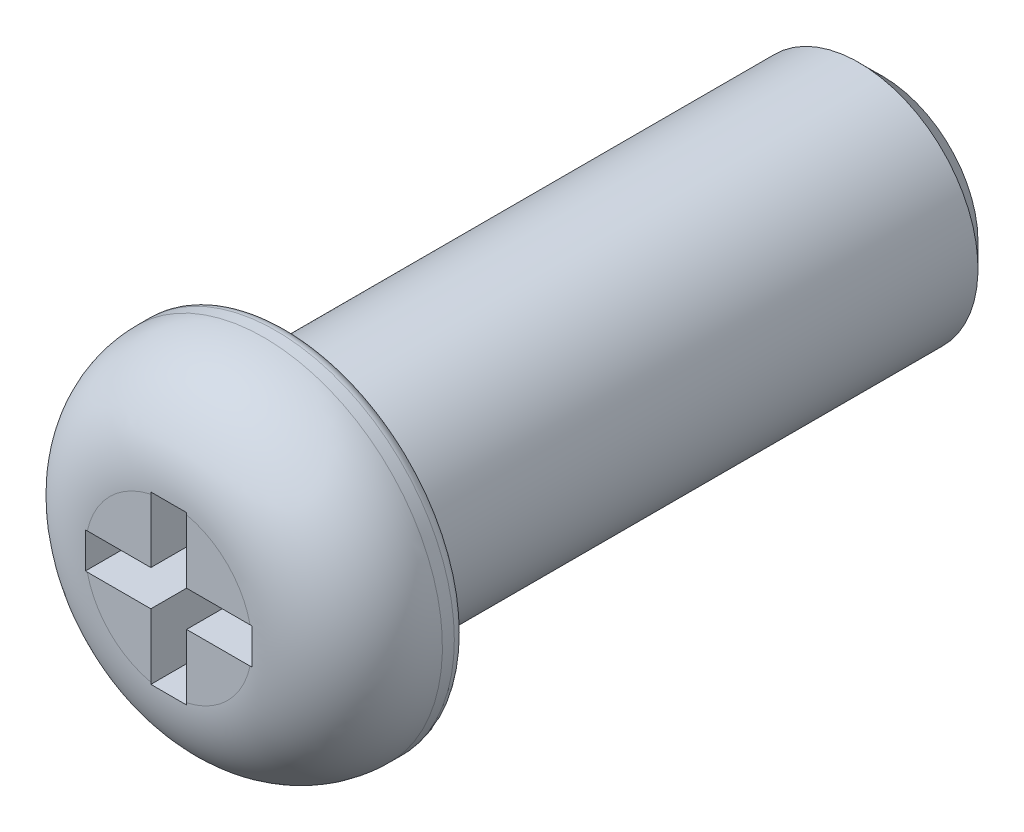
ISO-10303-21;
HEADER;
FILE_DESCRIPTION(('STEP AP214'),'2;1');
FILE_NAME('part.step','',(''),(''),'','','');
FILE_SCHEMA(('AUTOMOTIVE_DESIGN { 1 0 10303 214 1 1 1 1 }'));
ENDSEC;
DATA;
#1=APPLICATION_CONTEXT('core data for automotive mechanical design processes');
#2=APPLICATION_PROTOCOL_DEFINITION('international standard','automotive_design',2000,#1);
#3=PRODUCT_CONTEXT('',#1,'mechanical');
#4=PRODUCT('Part','Part','',(#3));
#5=PRODUCT_RELATED_PRODUCT_CATEGORY('part','',(#4));
#6=PRODUCT_DEFINITION_FORMATION('','',#4);
#7=PRODUCT_DEFINITION_CONTEXT('part definition',#1,'design');
#8=PRODUCT_DEFINITION('design','',#6,#7);
#9=PRODUCT_DEFINITION_SHAPE('','',#8);
#10=(LENGTH_UNIT() NAMED_UNIT(*) SI_UNIT(.MILLI.,.METRE.));
#11=(NAMED_UNIT(*) PLANE_ANGLE_UNIT() SI_UNIT($,.RADIAN.));
#12=(NAMED_UNIT(*) SI_UNIT($,.STERADIAN.) SOLID_ANGLE_UNIT());
#13=UNCERTAINTY_MEASURE_WITH_UNIT(LENGTH_MEASURE(1.E-05),#10,'distance_accuracy_value','');
#14=(GEOMETRIC_REPRESENTATION_CONTEXT(3) GLOBAL_UNCERTAINTY_ASSIGNED_CONTEXT((#13)) GLOBAL_UNIT_ASSIGNED_CONTEXT((#10,
#11,#12)) REPRESENTATION_CONTEXT('',''));
#15=CARTESIAN_POINT('',(0.,0.,0.));
#16=DIRECTION('',(0.,0.,1.));
#17=DIRECTION('',(1.,0.,0.));
#18=AXIS2_PLACEMENT_3D('',#15,#16,#17);
#19=CARTESIAN_POINT('',(0.,0.,5.2));
#20=DIRECTION('',(0.,0.,1.));
#21=DIRECTION('',(1.,0.,0.));
#22=AXIS2_PLACEMENT_3D('',#19,#20,#21);
#23=PLANE('',#22);
#24=DIRECTION('',(0.,-1.,0.));
#25=VECTOR('',#24,1.);
#26=CARTESIAN_POINT('',(0.15,0.,5.2));
#27=LINE('',#26,#25);
#28=CARTESIAN_POINT('',(0.15,0.7,5.2));
#29=VERTEX_POINT('',#28);
#30=CARTESIAN_POINT('',(0.15,0.15,5.2));
#31=VERTEX_POINT('',#30);
#32=EDGE_CURVE('E452',#29,#31,#27,.T.);
#33=ORIENTED_EDGE('',*,*,#32,.F.);
#34=DIRECTION('',(1.,0.,0.));
#35=VECTOR('',#34,1.);
#36=CARTESIAN_POINT('',(0.,0.7,5.2));
#37=LINE('',#36,#35);
#38=CARTESIAN_POINT('',(-0.15,0.7,5.2));
#39=VERTEX_POINT('',#38);
#40=EDGE_CURVE('E146',#39,#29,#37,.T.);
#41=ORIENTED_EDGE('',*,*,#40,.F.);
#42=DIRECTION('',(0.,-1.,0.));
#43=VECTOR('',#42,1.);
#44=CARTESIAN_POINT('',(-0.15,0.,5.2));
#45=LINE('',#44,#43);
#46=CARTESIAN_POINT('',(-0.15,0.15,5.2));
#47=VERTEX_POINT('',#46);
#48=EDGE_CURVE('E143',#39,#47,#45,.T.);
#49=ORIENTED_EDGE('',*,*,#48,.T.);
#50=DIRECTION('',(1.,0.,0.));
#51=VECTOR('',#50,1.);
#52=CARTESIAN_POINT('',(0.,0.15,5.2));
#53=LINE('',#52,#51);
#54=CARTESIAN_POINT('',(-0.7,0.15,5.2));
#55=VERTEX_POINT('',#54);
#56=EDGE_CURVE('E736',#55,#47,#53,.T.);
#57=ORIENTED_EDGE('',*,*,#56,.F.);
#58=DIRECTION('',(0.,1.,0.));
#59=VECTOR('',#58,1.);
#60=CARTESIAN_POINT('',(-0.7,0.,5.2));
#61=LINE('',#60,#59);
#62=CARTESIAN_POINT('',(-0.7,-0.15,5.2));
#63=VERTEX_POINT('',#62);
#64=EDGE_CURVE('E201',#55,#63,#61,.F.);
#65=ORIENTED_EDGE('',*,*,#64,.T.);
#66=DIRECTION('',(1.,0.,0.));
#67=VECTOR('',#66,1.);
#68=CARTESIAN_POINT('',(0.,-0.15,5.2));
#69=LINE('',#68,#67);
#70=CARTESIAN_POINT('',(-0.15,-0.15,5.2));
#71=VERTEX_POINT('',#70);
#72=EDGE_CURVE('E501',#63,#71,#69,.T.);
#73=ORIENTED_EDGE('',*,*,#72,.T.);
#74=DIRECTION('',(0.,-1.,0.));
#75=VECTOR('',#74,1.);
#76=CARTESIAN_POINT('',(-0.15,0.,5.2));
#77=LINE('',#76,#75);
#78=CARTESIAN_POINT('',(-0.15,-0.7,5.2));
#79=VERTEX_POINT('',#78);
#80=EDGE_CURVE('E503',#71,#79,#77,.T.);
#81=ORIENTED_EDGE('',*,*,#80,.T.);
#82=DIRECTION('',(1.,0.,0.));
#83=VECTOR('',#82,1.);
#84=CARTESIAN_POINT('',(0.,-0.7,5.2));
#85=LINE('',#84,#83);
#86=CARTESIAN_POINT('',(0.15,-0.7,5.2));
#87=VERTEX_POINT('',#86);
#88=EDGE_CURVE('E516',#79,#87,#85,.T.);
#89=ORIENTED_EDGE('',*,*,#88,.T.);
#90=DIRECTION('',(0.,-1.,0.));
#91=VECTOR('',#90,1.);
#92=CARTESIAN_POINT('',(0.15,0.,5.2));
#93=LINE('',#92,#91);
#94=CARTESIAN_POINT('',(0.15,-0.15,5.2));
#95=VERTEX_POINT('',#94);
#96=EDGE_CURVE('E524',#95,#87,#93,.T.);
#97=ORIENTED_EDGE('',*,*,#96,.F.);
#98=DIRECTION('',(1.,0.,0.));
#99=VECTOR('',#98,1.);
#100=CARTESIAN_POINT('',(0.,-0.15,5.2));
#101=LINE('',#100,#99);
#102=CARTESIAN_POINT('',(0.7,-0.15,5.2));
#103=VERTEX_POINT('',#102);
#104=EDGE_CURVE('E310',#95,#103,#101,.T.);
#105=ORIENTED_EDGE('',*,*,#104,.T.);
#106=DIRECTION('',(0.,1.,0.));
#107=VECTOR('',#106,1.);
#108=CARTESIAN_POINT('',(0.7,0.,5.2));
#109=LINE('',#108,#107);
#110=CARTESIAN_POINT('',(0.7,0.15,5.2));
#111=VERTEX_POINT('',#110);
#112=EDGE_CURVE('E316',#111,#103,#109,.F.);
#113=ORIENTED_EDGE('',*,*,#112,.F.);
#114=DIRECTION('',(1.,0.,0.));
#115=VECTOR('',#114,1.);
#116=CARTESIAN_POINT('',(0.,0.15,5.2));
#117=LINE('',#116,#115);
#118=EDGE_CURVE('E317',#31,#111,#117,.T.);
#119=ORIENTED_EDGE('',*,*,#118,.F.);
#120=EDGE_LOOP('',(#33,#41,#49,#57,#65,#73,#81,#89,#97,#105,#113,#119));
#121=FACE_BOUND('',#120,.T.);
#122=ADVANCED_FACE('F17',(#121),#23,.T.);
#123=CARTESIAN_POINT('',(0.,0.15,5.2));
#124=DIRECTION('',(0.,-1.,0.));
#125=DIRECTION('',(0.,0.,-1.));
#126=AXIS2_PLACEMENT_3D('',#123,#124,#125);
#127=PLANE('',#126);
#128=ORIENTED_EDGE('',*,*,#56,.T.);
#129=DIRECTION('',(0.,0.,1.));
#130=VECTOR('',#129,1.);
#131=CARTESIAN_POINT('',(-0.15,0.15,5.2));
#132=LINE('',#131,#130);
#133=CARTESIAN_POINT('',(-0.15,0.15,6.));
#134=VERTEX_POINT('',#133);
#135=EDGE_CURVE('E467',#47,#134,#132,.T.);
#136=ORIENTED_EDGE('',*,*,#135,.T.);
#137=DIRECTION('',(1.,0.,0.));
#138=VECTOR('',#137,1.);
#139=CARTESIAN_POINT('',(0.,0.15,6.));
#140=LINE('',#139,#138);
#141=CARTESIAN_POINT('',(-0.683739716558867,0.15,6.));
#142=VERTEX_POINT('',#141);
#143=EDGE_CURVE('E468',#142,#134,#140,.T.);
#144=ORIENTED_EDGE('',*,*,#143,.F.);
#145=CARTESIAN_POINT('',(-0.7,0.15,5.99984215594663));
#146=CARTESIAN_POINT('',(-0.697290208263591,0.15,5.99989478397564));
#147=CARTESIAN_POINT('',(-0.694580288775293,0.15,5.99993425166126));
#148=CARTESIAN_POINT('',(-0.689160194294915,0.15,5.99998686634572));
#149=CARTESIAN_POINT('',(-0.686450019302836,0.15,6.00000001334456));
#150=CARTESIAN_POINT('',(-0.683739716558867,0.15,6.));
#151=B_SPLINE_CURVE_WITH_KNOTS('',3,(#145,#146,#147,#148,#149,#150),.UNSPECIFIED.,.F.,.F.,(4,2,
4),(0.,0.00813062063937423,0.0162612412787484),.UNSPECIFIED.);
#152=CARTESIAN_POINT('',(-0.7,0.15,5.99984215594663));
#153=VERTEX_POINT('',#152);
#154=EDGE_CURVE('E166',#153,#142,#151,.T.);
#155=ORIENTED_EDGE('',*,*,#154,.F.);
#156=DIRECTION('',(0.,0.,1.));
#157=VECTOR('',#156,1.);
#158=CARTESIAN_POINT('',(-0.7,0.15,5.2));
#159=LINE('',#158,#157);
#160=EDGE_CURVE('E200',#153,#55,#159,.F.);
#161=ORIENTED_EDGE('',*,*,#160,.T.);
#162=EDGE_LOOP('',(#128,#136,#144,#155,#161));
#163=FACE_BOUND('',#162,.T.);
#164=ADVANCED_FACE('F691',(#163),#127,.T.);
#165=CARTESIAN_POINT('',(0.,0.,6.));
#166=DIRECTION('',(0.,0.,1.));
#167=DIRECTION('',(1.,0.,0.));
#168=AXIS2_PLACEMENT_3D('',#165,#166,#167);
#169=PLANE('',#168);
#170=CARTESIAN_POINT('',(0.,0.,6.));
#171=DIRECTION('',(0.,0.,-1.));
#172=DIRECTION('',(-0.976771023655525,0.214285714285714,0.));
#173=AXIS2_PLACEMENT_3D('',#170,#171,#172);
#174=CIRCLE('',#173,0.7);
#175=CARTESIAN_POINT('',(-0.15,0.683739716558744,6.));
#176=VERTEX_POINT('',#175);
#177=EDGE_CURVE('E163',#142,#176,#174,.T.);
#178=ORIENTED_EDGE('',*,*,#177,.F.);
#179=ORIENTED_EDGE('',*,*,#143,.T.);
#180=DIRECTION('',(0.,-1.,0.));
#181=VECTOR('',#180,1.);
#182=CARTESIAN_POINT('',(-0.15,0.,6.));
#183=LINE('',#182,#181);
#184=EDGE_CURVE('E147',#134,#176,#183,.F.);
#185=ORIENTED_EDGE('',*,*,#184,.T.);
#186=EDGE_LOOP('',(#178,#179,#185));
#187=FACE_BOUND('',#186,.T.);
#188=ADVANCED_FACE('F684',(#187),#169,.T.);
#189=CARTESIAN_POINT('',(-0.15,0.,5.2));
#190=DIRECTION('',(-1.,0.,0.));
#191=DIRECTION('',(0.,-1.,0.));
#192=AXIS2_PLACEMENT_3D('',#189,#190,#191);
#193=PLANE('',#192);
#194=CARTESIAN_POINT('',(-0.15,0.683739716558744,6.));
#195=CARTESIAN_POINT('',(-0.15,0.686450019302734,6.00000001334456));
#196=CARTESIAN_POINT('',(-0.15,0.689160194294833,5.99998686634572));
#197=CARTESIAN_POINT('',(-0.15,0.694580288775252,5.99993425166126));
#198=CARTESIAN_POINT('',(-0.15,0.697290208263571,5.99989478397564));
#199=CARTESIAN_POINT('',(-0.150000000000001,0.7,5.99984215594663));
#200=B_SPLINE_CURVE_WITH_KNOTS('',3,(#194,#195,#196,#197,#198,#199),.UNSPECIFIED.,.F.,.F.,(4,2,
4),(0.,0.00813062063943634,0.0162612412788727),.UNSPECIFIED.);
#201=CARTESIAN_POINT('',(-0.15,0.7,5.99984215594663));
#202=VERTEX_POINT('',#201);
#203=EDGE_CURVE('E140',#176,#202,#200,.T.);
#204=ORIENTED_EDGE('',*,*,#203,.F.);
#205=ORIENTED_EDGE('',*,*,#184,.F.);
#206=ORIENTED_EDGE('',*,*,#135,.F.);
#207=ORIENTED_EDGE('',*,*,#48,.F.);
#208=DIRECTION('',(0.,0.,-1.));
#209=VECTOR('',#208,1.);
#210=CARTESIAN_POINT('',(-0.15,0.7,5.2));
#211=LINE('',#210,#209);
#212=EDGE_CURVE('E135',#202,#39,#211,.T.);
#213=ORIENTED_EDGE('',*,*,#212,.F.);
#214=EDGE_LOOP('',(#204,#205,#206,#207,#213));
#215=FACE_BOUND('',#214,.T.);
#216=ADVANCED_FACE('F137',(#215),#193,.F.);
#217=CARTESIAN_POINT('',(0.,0.7,5.2));
#218=DIRECTION('',(0.,-1.,0.));
#219=DIRECTION('',(0.,0.,-1.));
#220=AXIS2_PLACEMENT_3D('',#217,#218,#219);
#221=PLANE('',#220);
#222=ORIENTED_EDGE('',*,*,#212,.T.);
#223=ORIENTED_EDGE('',*,*,#40,.T.);
#224=DIRECTION('',(0.,0.,1.));
#225=VECTOR('',#224,1.);
#226=CARTESIAN_POINT('',(0.15,0.7,5.2));
#227=LINE('',#226,#225);
#228=CARTESIAN_POINT('',(0.15,0.7,5.99984215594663));
#229=VERTEX_POINT('',#228);
#230=EDGE_CURVE('E153',#229,#29,#227,.F.);
#231=ORIENTED_EDGE('',*,*,#230,.F.);
#232=CARTESIAN_POINT('',(-0.15,0.700000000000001,5.99984215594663));
#233=CARTESIAN_POINT('',(-0.125000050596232,0.7,5.99993400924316));
#234=CARTESIAN_POINT('',(-0.100000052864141,0.7,5.99997347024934));
#235=CARTESIAN_POINT('',(-0.0500000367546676,0.7,6.00000646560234));
#236=CARTESIAN_POINT('',(-0.0250000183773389,0.7,6.));
#237=CARTESIAN_POINT('',(0.0250000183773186,0.7,6.));
#238=CARTESIAN_POINT('',(0.0500000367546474,0.7,6.00000646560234));
#239=CARTESIAN_POINT('',(0.100000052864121,0.7,5.99997347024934));
#240=CARTESIAN_POINT('',(0.125000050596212,0.7,5.99993400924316));
#241=CARTESIAN_POINT('',(0.14999999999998,0.7,5.99984215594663));
#242=B_SPLINE_CURVE_WITH_KNOTS('',3,(#232,#233,#234,#235,#236,#237,#238,#239,#240,#241),
.UNSPECIFIED.,.F.,.F.,(4,2,2,2,4),(0.,0.0750001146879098,0.15000014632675,0.22500017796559,
0.3000002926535),.UNSPECIFIED.);
#243=EDGE_CURVE('E150',#202,#229,#242,.T.);
#244=ORIENTED_EDGE('',*,*,#243,.F.);
#245=EDGE_LOOP('',(#222,#223,#231,#244));
#246=FACE_BOUND('',#245,.T.);
#247=ADVANCED_FACE('F151',(#246),#221,.T.);
#248=CARTESIAN_POINT('',(0.15,0.,5.2));
#249=DIRECTION('',(-1.,0.,0.));
#250=DIRECTION('',(0.,-1.,0.));
#251=AXIS2_PLACEMENT_3D('',#248,#249,#250);
#252=PLANE('',#251);
#253=ORIENTED_EDGE('',*,*,#32,.T.);
#254=DIRECTION('',(0.,0.,-1.));
#255=VECTOR('',#254,1.);
#256=CARTESIAN_POINT('',(0.15,0.15,5.2));
#257=LINE('',#256,#255);
#258=CARTESIAN_POINT('',(0.15,0.15,6.));
#259=VERTEX_POINT('',#258);
#260=EDGE_CURVE('E323',#259,#31,#257,.T.);
#261=ORIENTED_EDGE('',*,*,#260,.F.);
#262=DIRECTION('',(0.,1.,0.));
#263=VECTOR('',#262,1.);
#264=CARTESIAN_POINT('',(0.15,0.,6.));
#265=LINE('',#264,#263);
#266=CARTESIAN_POINT('',(0.15,0.683739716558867,6.));
#267=VERTEX_POINT('',#266);
#268=EDGE_CURVE('E324',#267,#259,#265,.F.);
#269=ORIENTED_EDGE('',*,*,#268,.F.);
#270=CARTESIAN_POINT('',(0.15,0.7,5.99984215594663));
#271=CARTESIAN_POINT('',(0.15,0.697290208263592,5.99989478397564));
#272=CARTESIAN_POINT('',(0.15,0.694580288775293,5.99993425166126));
#273=CARTESIAN_POINT('',(0.15,0.689160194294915,5.99998686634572));
#274=CARTESIAN_POINT('',(0.15,0.686450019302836,6.00000001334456));
#275=CARTESIAN_POINT('',(0.15,0.683739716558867,6.));
#276=B_SPLINE_CURVE_WITH_KNOTS('',3,(#270,#271,#272,#273,#274,#275),.UNSPECIFIED.,.F.,.F.,(4,2,
4),(0.,0.00813062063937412,0.0162612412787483),.UNSPECIFIED.);
#277=EDGE_CURVE('E157',#229,#267,#276,.T.);
#278=ORIENTED_EDGE('',*,*,#277,.F.);
#279=ORIENTED_EDGE('',*,*,#230,.T.);
#280=EDGE_LOOP('',(#253,#261,#269,#278,#279));
#281=FACE_BOUND('',#280,.T.);
#282=ADVANCED_FACE('F348',(#281),#252,.T.);
#283=CARTESIAN_POINT('',(0.,0.,6.));
#284=DIRECTION('',(0.,0.,1.));
#285=DIRECTION('',(1.,0.,0.));
#286=AXIS2_PLACEMENT_3D('',#283,#284,#285);
#287=PLANE('',#286);
#288=CARTESIAN_POINT('',(0.,0.,6.));
#289=DIRECTION('',(0.,0.,-1.));
#290=DIRECTION('',(0.214285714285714,0.976771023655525,0.));
#291=AXIS2_PLACEMENT_3D('',#288,#289,#290);
#292=CIRCLE('',#291,0.7);
#293=CARTESIAN_POINT('',(0.683739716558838,0.15,6.));
#294=VERTEX_POINT('',#293);
#295=EDGE_CURVE('E331',#267,#294,#292,.T.);
#296=ORIENTED_EDGE('',*,*,#295,.F.);
#297=ORIENTED_EDGE('',*,*,#268,.T.);
#298=DIRECTION('',(1.,0.,0.));
#299=VECTOR('',#298,1.);
#300=CARTESIAN_POINT('',(0.,0.15,6.));
#301=LINE('',#300,#299);
#302=EDGE_CURVE('E320',#294,#259,#301,.F.);
#303=ORIENTED_EDGE('',*,*,#302,.F.);
#304=EDGE_LOOP('',(#296,#297,#303));
#305=FACE_BOUND('',#304,.T.);
#306=ADVANCED_FACE('F337',(#305),#287,.T.);
#307=CARTESIAN_POINT('',(0.,0.15,5.2));
#308=DIRECTION('',(0.,-1.,0.));
#309=DIRECTION('',(0.,0.,-1.));
#310=AXIS2_PLACEMENT_3D('',#307,#308,#309);
#311=PLANE('',#310);
#312=ORIENTED_EDGE('',*,*,#260,.T.);
#313=ORIENTED_EDGE('',*,*,#118,.T.);
#314=DIRECTION('',(0.,0.,1.));
#315=VECTOR('',#314,1.);
#316=CARTESIAN_POINT('',(0.7,0.15,5.2));
#317=LINE('',#316,#315);
#318=CARTESIAN_POINT('',(0.700000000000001,0.15,5.99984215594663));
#319=VERTEX_POINT('',#318);
#320=EDGE_CURVE('E313',#319,#111,#317,.F.);
#321=ORIENTED_EDGE('',*,*,#320,.F.);
#322=CARTESIAN_POINT('',(0.683739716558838,0.15,6.));
#323=CARTESIAN_POINT('',(0.686450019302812,0.15,6.00000001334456));
#324=CARTESIAN_POINT('',(0.689160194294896,0.15,5.99998686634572));
#325=CARTESIAN_POINT('',(0.694580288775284,0.15,5.99993425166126));
#326=CARTESIAN_POINT('',(0.697290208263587,0.15,5.99989478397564));
#327=CARTESIAN_POINT('',(0.700000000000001,0.15,5.99984215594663));
#328=B_SPLINE_CURVE_WITH_KNOTS('',3,(#322,#323,#324,#325,#326,#327),.UNSPECIFIED.,.F.,.F.,(4,2,
4),(0.,0.00813062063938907,0.0162612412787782),.UNSPECIFIED.);
#329=EDGE_CURVE('E365',#294,#319,#328,.T.);
#330=ORIENTED_EDGE('',*,*,#329,.F.);
#331=ORIENTED_EDGE('',*,*,#302,.T.);
#332=EDGE_LOOP('',(#312,#313,#321,#330,#331));
#333=FACE_BOUND('',#332,.T.);
#334=ADVANCED_FACE('F347',(#333),#311,.T.);
#335=CARTESIAN_POINT('',(0.7,0.,5.2));
#336=DIRECTION('',(-1.,0.,0.));
#337=DIRECTION('',(0.,0.,1.));
#338=AXIS2_PLACEMENT_3D('',#335,#336,#337);
#339=PLANE('',#338);
#340=ORIENTED_EDGE('',*,*,#320,.T.);
#341=ORIENTED_EDGE('',*,*,#112,.T.);
#342=DIRECTION('',(0.,0.,-1.));
#343=VECTOR('',#342,1.);
#344=CARTESIAN_POINT('',(0.7,-0.15,5.2));
#345=LINE('',#344,#343);
#346=CARTESIAN_POINT('',(0.7,-0.15,5.99984215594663));
#347=VERTEX_POINT('',#346);
#348=EDGE_CURVE('E295',#103,#347,#345,.F.);
#349=ORIENTED_EDGE('',*,*,#348,.T.);
#350=CARTESIAN_POINT('',(0.700000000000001,0.15,5.99984215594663));
#351=CARTESIAN_POINT('',(0.7,0.12500005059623,5.99993400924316));
#352=CARTESIAN_POINT('',(0.7,0.100000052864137,5.99997347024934));
#353=CARTESIAN_POINT('',(0.7,0.0500000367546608,6.00000646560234));
#354=CARTESIAN_POINT('',(0.7,0.0250000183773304,6.));
#355=CARTESIAN_POINT('',(0.7,-0.0250000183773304,6.));
#356=CARTESIAN_POINT('',(0.7,-0.0500000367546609,6.00000646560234));
#357=CARTESIAN_POINT('',(0.7,-0.100000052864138,5.99997347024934));
#358=CARTESIAN_POINT('',(0.7,-0.12500005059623,5.99993400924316));
#359=CARTESIAN_POINT('',(0.700000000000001,-0.15,5.99984215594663));
#360=B_SPLINE_CURVE_WITH_KNOTS('',3,(#350,#351,#352,#353,#354,#355,#356,#357,#358,#359),
.UNSPECIFIED.,.F.,.F.,(4,2,2,2,4),(0.,0.0750001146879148,0.15000014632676,0.225000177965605,
0.30000029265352),.UNSPECIFIED.);
#361=EDGE_CURVE('E368',#319,#347,#360,.T.);
#362=ORIENTED_EDGE('',*,*,#361,.F.);
#363=EDGE_LOOP('',(#340,#341,#349,#362));
#364=FACE_BOUND('',#363,.T.);
#365=ADVANCED_FACE('F377',(#364),#339,.T.);
#366=CARTESIAN_POINT('',(0.,-0.15,5.2));
#367=DIRECTION('',(0.,-1.,0.));
#368=DIRECTION('',(0.,0.,-1.));
#369=AXIS2_PLACEMENT_3D('',#366,#367,#368);
#370=PLANE('',#369);
#371=CARTESIAN_POINT('',(0.700000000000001,-0.15,5.99984215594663));
#372=CARTESIAN_POINT('',(0.697290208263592,-0.15,5.99989478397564));
#373=CARTESIAN_POINT('',(0.694580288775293,-0.15,5.99993425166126));
#374=CARTESIAN_POINT('',(0.689160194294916,-0.15,5.99998686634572));
#375=CARTESIAN_POINT('',(0.686450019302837,-0.15,6.00000001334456));
#376=CARTESIAN_POINT('',(0.683739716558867,-0.15,6.));
#377=B_SPLINE_CURVE_WITH_KNOTS('',3,(#371,#372,#373,#374,#375,#376),.UNSPECIFIED.,.F.,.F.,(4,2,
4),(0.,0.00813062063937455,0.0162612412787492),.UNSPECIFIED.);
#378=CARTESIAN_POINT('',(0.683739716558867,-0.15,6.));
#379=VERTEX_POINT('',#378);
#380=EDGE_CURVE('E265',#347,#379,#377,.T.);
#381=ORIENTED_EDGE('',*,*,#380,.F.);
#382=ORIENTED_EDGE('',*,*,#348,.F.);
#383=ORIENTED_EDGE('',*,*,#104,.F.);
#384=DIRECTION('',(0.,0.,1.));
#385=VECTOR('',#384,1.);
#386=CARTESIAN_POINT('',(0.15,-0.15,5.2));
#387=LINE('',#386,#385);
#388=CARTESIAN_POINT('',(0.15,-0.15,6.));
#389=VERTEX_POINT('',#388);
#390=EDGE_CURVE('E520',#389,#95,#387,.F.);
#391=ORIENTED_EDGE('',*,*,#390,.F.);
#392=DIRECTION('',(1.,0.,0.));
#393=VECTOR('',#392,1.);
#394=CARTESIAN_POINT('',(0.,-0.15,6.));
#395=LINE('',#394,#393);
#396=EDGE_CURVE('E287',#379,#389,#395,.F.);
#397=ORIENTED_EDGE('',*,*,#396,.F.);
#398=EDGE_LOOP('',(#381,#382,#383,#391,#397));
#399=FACE_BOUND('',#398,.T.);
#400=ADVANCED_FACE('F276',(#399),#370,.F.);
#401=CARTESIAN_POINT('',(0.,0.,6.));
#402=DIRECTION('',(0.,0.,1.));
#403=DIRECTION('',(1.,0.,0.));
#404=AXIS2_PLACEMENT_3D('',#401,#402,#403);
#405=PLANE('',#404);
#406=CARTESIAN_POINT('',(0.,0.,6.));
#407=DIRECTION('',(0.,0.,-1.));
#408=DIRECTION('',(0.976771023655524,-0.214285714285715,0.));
#409=AXIS2_PLACEMENT_3D('',#406,#407,#408);
#410=CIRCLE('',#409,0.7);
#411=CARTESIAN_POINT('',(0.15,-0.683739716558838,6.));
#412=VERTEX_POINT('',#411);
#413=EDGE_CURVE('E259',#379,#412,#410,.T.);
#414=ORIENTED_EDGE('',*,*,#413,.F.);
#415=ORIENTED_EDGE('',*,*,#396,.T.);
#416=DIRECTION('',(0.,-1.,0.));
#417=VECTOR('',#416,1.);
#418=CARTESIAN_POINT('',(0.15,0.,6.));
#419=LINE('',#418,#417);
#420=EDGE_CURVE('E294',#412,#389,#419,.F.);
#421=ORIENTED_EDGE('',*,*,#420,.F.);
#422=EDGE_LOOP('',(#414,#415,#421));
#423=FACE_BOUND('',#422,.T.);
#424=ADVANCED_FACE('F271',(#423),#405,.T.);
#425=CARTESIAN_POINT('',(0.15,0.,5.2));
#426=DIRECTION('',(-1.,0.,0.));
#427=DIRECTION('',(0.,-1.,0.));
#428=AXIS2_PLACEMENT_3D('',#425,#426,#427);
#429=PLANE('',#428);
#430=ORIENTED_EDGE('',*,*,#390,.T.);
#431=ORIENTED_EDGE('',*,*,#96,.T.);
#432=DIRECTION('',(0.,0.,1.));
#433=VECTOR('',#432,1.);
#434=CARTESIAN_POINT('',(0.15,-0.7,5.2));
#435=LINE('',#434,#433);
#436=CARTESIAN_POINT('',(0.15,-0.7,5.99984215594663));
#437=VERTEX_POINT('',#436);
#438=EDGE_CURVE('E507',#87,#437,#435,.T.);
#439=ORIENTED_EDGE('',*,*,#438,.T.);
#440=CARTESIAN_POINT('',(0.15,-0.683739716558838,6.));
#441=CARTESIAN_POINT('',(0.15,-0.686450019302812,6.00000001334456));
#442=CARTESIAN_POINT('',(0.15,-0.689160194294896,5.99998686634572));
#443=CARTESIAN_POINT('',(0.15,-0.694580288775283,5.99993425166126));
#444=CARTESIAN_POINT('',(0.15,-0.697290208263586,5.99989478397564));
#445=CARTESIAN_POINT('',(0.15,-0.699999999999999,5.99984215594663));
#446=B_SPLINE_CURVE_WITH_KNOTS('',3,(#440,#441,#442,#443,#444,#445),.UNSPECIFIED.,.F.,.F.,(4,2,
4),(0.,0.00813062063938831,0.0162612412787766),.UNSPECIFIED.);
#447=EDGE_CURVE('E256',#412,#437,#446,.T.);
#448=ORIENTED_EDGE('',*,*,#447,.F.);
#449=ORIENTED_EDGE('',*,*,#420,.T.);
#450=EDGE_LOOP('',(#430,#431,#439,#448,#449));
#451=FACE_BOUND('',#450,.T.);
#452=ADVANCED_FACE('F267',(#451),#429,.T.);
#453=CARTESIAN_POINT('',(0.,-0.7,5.2));
#454=DIRECTION('',(0.,-1.,0.));
#455=DIRECTION('',(1.,0.,0.));
#456=AXIS2_PLACEMENT_3D('',#453,#454,#455);
#457=PLANE('',#456);
#458=CARTESIAN_POINT('',(0.15,-0.700000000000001,5.99984215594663));
#459=CARTESIAN_POINT('',(0.125000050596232,-0.7,5.99993400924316));
#460=CARTESIAN_POINT('',(0.100000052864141,-0.7,5.99997347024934));
#461=CARTESIAN_POINT('',(0.0500000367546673,-0.7,6.00000646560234));
#462=CARTESIAN_POINT('',(0.0250000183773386,-0.7,6.));
#463=CARTESIAN_POINT('',(-0.0250000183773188,-0.7,6.));
#464=CARTESIAN_POINT('',(-0.0500000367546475,-0.7,6.00000646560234));
#465=CARTESIAN_POINT('',(-0.100000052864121,-0.7,5.99997347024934));
#466=CARTESIAN_POINT('',(-0.125000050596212,-0.7,5.99993400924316));
#467=CARTESIAN_POINT('',(-0.14999999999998,-0.700000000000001,5.99984215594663));
#468=B_SPLINE_CURVE_WITH_KNOTS('',3,(#458,#459,#460,#461,#462,#463,#464,#465,#466,#467),
.UNSPECIFIED.,.F.,.F.,(4,2,2,2,4),(0.,0.0750001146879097,0.15000014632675,0.22500017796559,
0.3000002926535),.UNSPECIFIED.);
#469=CARTESIAN_POINT('',(-0.15,-0.7,5.99984215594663));
#470=VERTEX_POINT('',#469);
#471=EDGE_CURVE('E250',#437,#470,#468,.T.);
#472=ORIENTED_EDGE('',*,*,#471,.F.);
#473=ORIENTED_EDGE('',*,*,#438,.F.);
#474=ORIENTED_EDGE('',*,*,#88,.F.);
#475=DIRECTION('',(0.,0.,1.));
#476=VECTOR('',#475,1.);
#477=CARTESIAN_POINT('',(-0.15,-0.7,5.2));
#478=LINE('',#477,#476);
#479=EDGE_CURVE('E498',#79,#470,#478,.T.);
#480=ORIENTED_EDGE('',*,*,#479,.T.);
#481=EDGE_LOOP('',(#472,#473,#474,#480));
#482=FACE_BOUND('',#481,.T.);
#483=ADVANCED_FACE('F237',(#482),#457,.F.);
#484=CARTESIAN_POINT('',(-0.15,0.,5.2));
#485=DIRECTION('',(-1.,0.,0.));
#486=DIRECTION('',(0.,-1.,0.));
#487=AXIS2_PLACEMENT_3D('',#484,#485,#486);
#488=PLANE('',#487);
#489=CARTESIAN_POINT('',(-0.15,-0.7,5.99984215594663));
#490=CARTESIAN_POINT('',(-0.15,-0.697290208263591,5.99989478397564));
#491=CARTESIAN_POINT('',(-0.15,-0.694580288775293,5.99993425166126));
#492=CARTESIAN_POINT('',(-0.15,-0.689160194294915,5.99998686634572));
#493=CARTESIAN_POINT('',(-0.15,-0.686450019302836,6.00000001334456));
#494=CARTESIAN_POINT('',(-0.150000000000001,-0.683739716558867,6.));
#495=B_SPLINE_CURVE_WITH_KNOTS('',3,(#489,#490,#491,#492,#493,#494),.UNSPECIFIED.,.F.,.F.,(4,2,
4),(0.,0.00813062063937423,0.0162612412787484),.UNSPECIFIED.);
#496=CARTESIAN_POINT('',(-0.15,-0.683739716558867,6.));
#497=VERTEX_POINT('',#496);
#498=EDGE_CURVE('E248',#470,#497,#495,.T.);
#499=ORIENTED_EDGE('',*,*,#498,.F.);
#500=ORIENTED_EDGE('',*,*,#479,.F.);
#501=ORIENTED_EDGE('',*,*,#80,.F.);
#502=DIRECTION('',(0.,0.,-1.));
#503=VECTOR('',#502,1.);
#504=CARTESIAN_POINT('',(-0.15,-0.15,5.2));
#505=LINE('',#504,#503);
#506=CARTESIAN_POINT('',(-0.15,-0.15,6.));
#507=VERTEX_POINT('',#506);
#508=EDGE_CURVE('E206',#71,#507,#505,.F.);
#509=ORIENTED_EDGE('',*,*,#508,.T.);
#510=DIRECTION('',(0.,1.,0.));
#511=VECTOR('',#510,1.);
#512=CARTESIAN_POINT('',(-0.15,0.,6.));
#513=LINE('',#512,#511);
#514=EDGE_CURVE('E220',#497,#507,#513,.T.);
#515=ORIENTED_EDGE('',*,*,#514,.F.);
#516=EDGE_LOOP('',(#499,#500,#501,#509,#515));
#517=FACE_BOUND('',#516,.T.);
#518=ADVANCED_FACE('F232',(#517),#488,.F.);
#519=CARTESIAN_POINT('',(0.,0.,6.));
#520=DIRECTION('',(0.,0.,1.));
#521=DIRECTION('',(1.,0.,0.));
#522=AXIS2_PLACEMENT_3D('',#519,#520,#521);
#523=PLANE('',#522);
#524=CARTESIAN_POINT('',(0.,0.,6.));
#525=DIRECTION('',(0.,0.,-1.));
#526=DIRECTION('',(-0.214285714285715,-0.976771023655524,0.));
#527=AXIS2_PLACEMENT_3D('',#524,#525,#526);
#528=CIRCLE('',#527,0.7);
#529=CARTESIAN_POINT('',(-0.68373971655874,-0.15,6.));
#530=VERTEX_POINT('',#529);
#531=EDGE_CURVE('E214',#497,#530,#528,.T.);
#532=ORIENTED_EDGE('',*,*,#531,.F.);
#533=ORIENTED_EDGE('',*,*,#514,.T.);
#534=DIRECTION('',(1.,0.,0.));
#535=VECTOR('',#534,1.);
#536=CARTESIAN_POINT('',(0.,-0.15,6.));
#537=LINE('',#536,#535);
#538=EDGE_CURVE('E204',#507,#530,#537,.F.);
#539=ORIENTED_EDGE('',*,*,#538,.T.);
#540=EDGE_LOOP('',(#532,#533,#539));
#541=FACE_BOUND('',#540,.T.);
#542=ADVANCED_FACE('F222',(#541),#523,.T.);
#543=CARTESIAN_POINT('',(0.,-0.15,5.2));
#544=DIRECTION('',(0.,-1.,0.));
#545=DIRECTION('',(0.,0.,-1.));
#546=AXIS2_PLACEMENT_3D('',#543,#544,#545);
#547=PLANE('',#546);
#548=CARTESIAN_POINT('',(-0.68373971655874,-0.15,6.));
#549=CARTESIAN_POINT('',(-0.686450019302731,-0.15,6.00000001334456));
#550=CARTESIAN_POINT('',(-0.689160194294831,-0.15,5.99998686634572));
#551=CARTESIAN_POINT('',(-0.69458028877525,-0.15,5.99993425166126));
#552=CARTESIAN_POINT('',(-0.697290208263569,-0.15,5.99989478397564));
#553=CARTESIAN_POINT('',(-0.699999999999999,-0.15,5.99984215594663));
#554=B_SPLINE_CURVE_WITH_KNOTS('',3,(#548,#549,#550,#551,#552,#553),.UNSPECIFIED.,.F.,.F.,(4,2,
4),(0.,0.0081306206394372,0.0162612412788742),.UNSPECIFIED.);
#555=CARTESIAN_POINT('',(-0.7,-0.15,5.99984215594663));
#556=VERTEX_POINT('',#555);
#557=EDGE_CURVE('E487',#530,#556,#554,.T.);
#558=ORIENTED_EDGE('',*,*,#557,.F.);
#559=ORIENTED_EDGE('',*,*,#538,.F.);
#560=ORIENTED_EDGE('',*,*,#508,.F.);
#561=ORIENTED_EDGE('',*,*,#72,.F.);
#562=DIRECTION('',(0.,0.,1.));
#563=VECTOR('',#562,1.);
#564=CARTESIAN_POINT('',(-0.7,-0.15,5.2));
#565=LINE('',#564,#563);
#566=EDGE_CURVE('E198',#63,#556,#565,.T.);
#567=ORIENTED_EDGE('',*,*,#566,.T.);
#568=EDGE_LOOP('',(#558,#559,#560,#561,#567));
#569=FACE_BOUND('',#568,.T.);
#570=ADVANCED_FACE('F231',(#569),#547,.F.);
#571=CARTESIAN_POINT('',(-0.7,0.,5.2));
#572=DIRECTION('',(-1.,0.,0.));
#573=DIRECTION('',(0.,0.,1.));
#574=AXIS2_PLACEMENT_3D('',#571,#572,#573);
#575=PLANE('',#574);
#576=ORIENTED_EDGE('',*,*,#160,.F.);
#577=CARTESIAN_POINT('',(-0.700000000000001,-0.15,5.99984215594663));
#578=CARTESIAN_POINT('',(-0.700000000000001,-0.12500005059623,5.99993400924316));
#579=CARTESIAN_POINT('',(-0.7,-0.100000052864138,5.99997347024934));
#580=CARTESIAN_POINT('',(-0.699999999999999,-0.0500000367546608,6.00000646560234));
#581=CARTESIAN_POINT('',(-0.699999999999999,-0.0250000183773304,6.));
#582=CARTESIAN_POINT('',(-0.699999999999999,0.0250000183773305,6.));
#583=CARTESIAN_POINT('',(-0.699999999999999,0.0500000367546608,6.00000646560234));
#584=CARTESIAN_POINT('',(-0.7,0.100000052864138,5.99997347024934));
#585=CARTESIAN_POINT('',(-0.700000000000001,0.12500005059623,5.99993400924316));
#586=CARTESIAN_POINT('',(-0.700000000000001,0.15,5.99984215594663));
#587=B_SPLINE_CURVE_WITH_KNOTS('',3,(#577,#578,#579,#580,#581,#582,#583,#584,#585,#586),
.UNSPECIFIED.,.F.,.F.,(4,2,2,2,4),(0.,0.0750001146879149,0.15000014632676,0.225000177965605,
0.30000029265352),.UNSPECIFIED.);
#588=EDGE_CURVE('E480',#556,#153,#587,.T.);
#589=ORIENTED_EDGE('',*,*,#588,.F.);
#590=ORIENTED_EDGE('',*,*,#566,.F.);
#591=ORIENTED_EDGE('',*,*,#64,.F.);
#592=EDGE_LOOP('',(#576,#589,#590,#591));
#593=FACE_BOUND('',#592,.T.);
#594=ADVANCED_FACE('F189',(#593),#575,.F.);
#595=CARTESIAN_POINT('',(0.7,0.,5.2));
#596=DIRECTION('',(0.,1.,0.));
#597=DIRECTION('',(1.,0.,0.));
#598=AXIS2_PLACEMENT_3D('',#595,#596,#597);
#599=CIRCLE('',#598,0.8);
#600=TRIMMED_CURVE('',#599,(PARAMETER_VALUE(-2.63623214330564)),
(PARAMETER_VALUE(2.63623214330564)),.T.,.PARAMETER.);
#601=CARTESIAN_POINT('',(0.,0.,5.2));
#602=DIRECTION('',(0.,0.,1.));
#603=AXIS1_PLACEMENT('',#601,#602);
#604=SURFACE_OF_REVOLUTION('',#600,#603);
#605=CARTESIAN_POINT('',(0.,0.,5.2));
#606=DIRECTION('',(0.,0.,-1.));
#607=DIRECTION('',(-1.,0.,0.));
#608=AXIS2_PLACEMENT_3D('',#605,#606,#607);
#609=CIRCLE('',#608,1.5);
#610=CARTESIAN_POINT('',(-1.5,0.,5.2));
#611=VERTEX_POINT('',#610);
#612=EDGE_CURVE('E486',#611,#611,#609,.T.);
#613=ORIENTED_EDGE('',*,*,#612,.F.);
#614=EDGE_LOOP('',(#613));
#615=FACE_BOUND('',#614,.T.);
#616=ORIENTED_EDGE('',*,*,#557,.T.);
#617=ORIENTED_EDGE('',*,*,#588,.T.);
#618=ORIENTED_EDGE('',*,*,#154,.T.);
#619=ORIENTED_EDGE('',*,*,#177,.T.);
#620=ORIENTED_EDGE('',*,*,#203,.T.);
#621=ORIENTED_EDGE('',*,*,#243,.T.);
#622=ORIENTED_EDGE('',*,*,#277,.T.);
#623=ORIENTED_EDGE('',*,*,#295,.T.);
#624=ORIENTED_EDGE('',*,*,#329,.T.);
#625=ORIENTED_EDGE('',*,*,#361,.T.);
#626=ORIENTED_EDGE('',*,*,#380,.T.);
#627=ORIENTED_EDGE('',*,*,#413,.T.);
#628=ORIENTED_EDGE('',*,*,#447,.T.);
#629=ORIENTED_EDGE('',*,*,#471,.T.);
#630=ORIENTED_EDGE('',*,*,#498,.T.);
#631=ORIENTED_EDGE('',*,*,#531,.T.);
#632=EDGE_LOOP('',(#616,#617,#618,#619,#620,#621,#622,#623,#624,#625,#626,#627,#628,#629,#630,#631));
#633=FACE_BOUND('',#632,.T.);
#634=ADVANCED_FACE('F160',(#615,#633),#604,.F.);
#635=CARTESIAN_POINT('',(0.,0.,6.));
#636=DIRECTION('',(0.,0.,-1.));
#637=DIRECTION('',(-1.,0.,0.));
#638=AXIS2_PLACEMENT_3D('',#635,#636,#637);
#639=CYLINDRICAL_SURFACE('',#638,1.5);
#640=ORIENTED_EDGE('',*,*,#612,.T.);
#641=EDGE_LOOP('',(#640));
#642=FACE_BOUND('',#641,.T.);
#643=CARTESIAN_POINT('',(0.,0.,5.1));
#644=DIRECTION('',(0.,0.,1.));
#645=DIRECTION('',(1.,0.,0.));
#646=AXIS2_PLACEMENT_3D('',#643,#644,#645);
#647=CIRCLE('',#646,1.5);
#648=CARTESIAN_POINT('',(1.5,0.,5.1));
#649=VERTEX_POINT('',#648);
#650=EDGE_CURVE('E784',#649,#649,#647,.F.);
#651=ORIENTED_EDGE('',*,*,#650,.F.);
#652=EDGE_LOOP('',(#651));
#653=FACE_BOUND('',#652,.T.);
#654=ADVANCED_FACE('F428',(#642,#653),#639,.T.);
#655=CARTESIAN_POINT('',(0.,0.,5.1));
#656=DIRECTION('',(0.,0.,1.));
#657=DIRECTION('',(1.,0.,0.));
#658=AXIS2_PLACEMENT_3D('',#655,#656,#657);
#659=TOROIDAL_SURFACE('',#658,1.4,0.1);
#660=CARTESIAN_POINT('',(0.,0.,5.));
#661=DIRECTION('',(0.,0.,1.));
#662=DIRECTION('',(1.,0.,0.));
#663=AXIS2_PLACEMENT_3D('',#660,#661,#662);
#664=CIRCLE('',#663,1.4);
#665=CARTESIAN_POINT('',(1.4,0.,5.));
#666=VERTEX_POINT('',#665);
#667=CARTESIAN_POINT('',(-1.4,0.,5.));
#668=VERTEX_POINT('',#667);
#669=EDGE_CURVE('E36',#666,#668,#664,.T.);
#670=ORIENTED_EDGE('',*,*,#669,.T.);
#671=CARTESIAN_POINT('',(0.,0.,5.));
#672=DIRECTION('',(0.,0.,1.));
#673=DIRECTION('',(-1.,0.,0.));
#674=AXIS2_PLACEMENT_3D('',#671,#672,#673);
#675=CIRCLE('',#674,1.4);
#676=EDGE_CURVE('E479',#668,#666,#675,.T.);
#677=ORIENTED_EDGE('',*,*,#676,.T.);
#678=EDGE_LOOP('',(#670,#677));
#679=FACE_BOUND('',#678,.T.);
#680=ORIENTED_EDGE('',*,*,#650,.T.);
#681=EDGE_LOOP('',(#680));
#682=FACE_BOUND('',#681,.T.);
#683=ADVANCED_FACE('F425',(#679,#682),#659,.T.);
#684=CARTESIAN_POINT('',(0.,0.,0.));
#685=DIRECTION('',(0.,0.,1.));
#686=DIRECTION('',(1.,0.,0.));
#687=AXIS2_PLACEMENT_3D('',#684,#685,#686);
#688=PLANE('',#687);
#689=CARTESIAN_POINT('',(0.,0.,5.6843418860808E-11));
#690=DIRECTION('',(0.,0.,1.));
#691=DIRECTION('',(0.,-1.,0.));
#692=AXIS2_PLACEMENT_3D('',#689,#690,#691);
#693=CIRCLE('',#692,0.800000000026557);
#694=CARTESIAN_POINT('',(0.,-0.800000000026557,5.68434297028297E-11));
#695=VERTEX_POINT('',#694);
#696=EDGE_CURVE('E476',#695,#695,#693,.T.);
#697=ORIENTED_EDGE('',*,*,#696,.F.);
#698=EDGE_LOOP('',(#697));
#699=FACE_BOUND('',#698,.T.);
#700=ADVANCED_FACE('F404',(#699),#688,.F.);
#701=CARTESIAN_POINT('',(0.,0.,5.));
#702=DIRECTION('',(0.,0.,1.));
#703=DIRECTION('',(1.,0.,0.));
#704=AXIS2_PLACEMENT_3D('',#701,#702,#703);
#705=PLANE('',#704);
#706=CARTESIAN_POINT('',(0.,0.,5.));
#707=DIRECTION('',(0.,0.,-1.));
#708=DIRECTION('',(-1.,0.,0.));
#709=AXIS2_PLACEMENT_3D('',#706,#707,#708);
#710=CIRCLE('',#709,1.);
#711=CARTESIAN_POINT('',(-1.,0.,5.));
#712=VERTEX_POINT('',#711);
#713=EDGE_CURVE('E28',#712,#712,#710,.T.);
#714=ORIENTED_EDGE('',*,*,#713,.F.);
#715=EDGE_LOOP('',(#714));
#716=FACE_BOUND('',#715,.T.);
#717=ORIENTED_EDGE('',*,*,#669,.F.);
#718=ORIENTED_EDGE('',*,*,#676,.F.);
#719=EDGE_LOOP('',(#717,#718));
#720=FACE_BOUND('',#719,.T.);
#721=ADVANCED_FACE('F396',(#716,#720),#705,.F.);
#722=CARTESIAN_POINT('',(0.,0.,0.199999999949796));
#723=DIRECTION('',(0.,0.,1.));
#724=DIRECTION('',(0.,-1.,0.));
#725=AXIS2_PLACEMENT_3D('',#722,#723,#724);
#726=CONICAL_SURFACE('',#725,0.99999999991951,0.785398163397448);
#727=CARTESIAN_POINT('',(0.,0.,0.200000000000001));
#728=DIRECTION('',(0.,0.,-1.));
#729=DIRECTION('',(-1.,0.,0.));
#730=AXIS2_PLACEMENT_3D('',#727,#728,#729);
#731=CIRCLE('',#730,1.);
#732=CARTESIAN_POINT('',(-1.,0.,0.200000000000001));
#733=VERTEX_POINT('',#732);
#734=EDGE_CURVE('E11',#733,#733,#731,.F.);
#735=ORIENTED_EDGE('',*,*,#734,.F.);
#736=EDGE_LOOP('',(#735));
#737=FACE_BOUND('',#736,.T.);
#738=ORIENTED_EDGE('',*,*,#696,.T.);
#739=EDGE_LOOP('',(#738));
#740=FACE_BOUND('',#739,.T.);
#741=ADVANCED_FACE('F390',(#737,#740),#726,.T.);
#742=CARTESIAN_POINT('',(0.,0.,5.));
#743=DIRECTION('',(0.,0.,-1.));
#744=DIRECTION('',(-1.,0.,0.));
#745=AXIS2_PLACEMENT_3D('',#742,#743,#744);
#746=CYLINDRICAL_SURFACE('',#745,1.);
#747=ORIENTED_EDGE('',*,*,#734,.T.);
#748=EDGE_LOOP('',(#747));
#749=FACE_BOUND('',#748,.T.);
#750=ORIENTED_EDGE('',*,*,#713,.T.);
#751=EDGE_LOOP('',(#750));
#752=FACE_BOUND('',#751,.T.);
#753=ADVANCED_FACE('F388',(#749,#752),#746,.T.);
#754=CLOSED_SHELL('',(#122,#164,#188,#216,#247,#282,#306,#334,#365,#400,#424,#452,#483,#518,
#542,#570,#594,#634,#654,#683,#700,#721,#741,#753));
#755=MANIFOLD_SOLID_BREP('B1',#754);
#756=ADVANCED_BREP_SHAPE_REPRESENTATION('',(#18,#755),#14);
#757=SHAPE_DEFINITION_REPRESENTATION(#9,#756);
ENDSEC;
END-ISO-10303-21;
